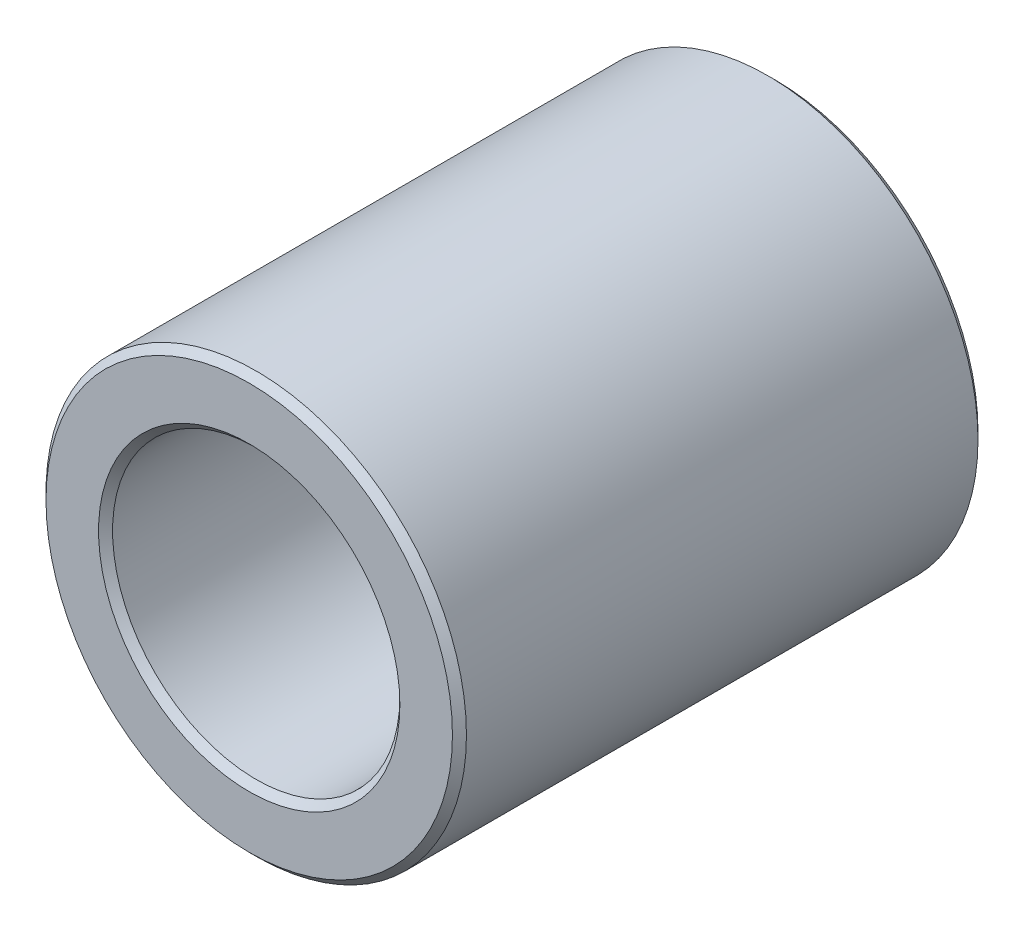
from build123d import *

# Parameters (mm, degrees)
SKETCH1_R           = 6
SKETCH1_R_2         = 4.1
BOSS_EXTRUDE2_DEPTH = 7.5
CHAMFER3_SIZE       = 0.2


with BuildPart() as part:
    # Sketch1 → Boss-Extrude2 (new, symmetric)
    with BuildSketch(Plane.XY):
        Circle(SKETCH1_R)
        Circle(SKETCH1_R_2, mode=Mode.SUBTRACT)
    extrude(amount=BOSS_EXTRUDE2_DEPTH, both=True)

    # Chamfer3
    chamfer3_edges = [part.edges().sort_by_distance(p)[0] for p in [
        (-6, 0, -7.5),
        (-6, 0, 7.5),
        (-4.1, 0, -7.5),
        (-4.1, 0, 7.5),
    ]]
    chamfer(chamfer3_edges, length=CHAMFER3_SIZE)


solid = part.part
